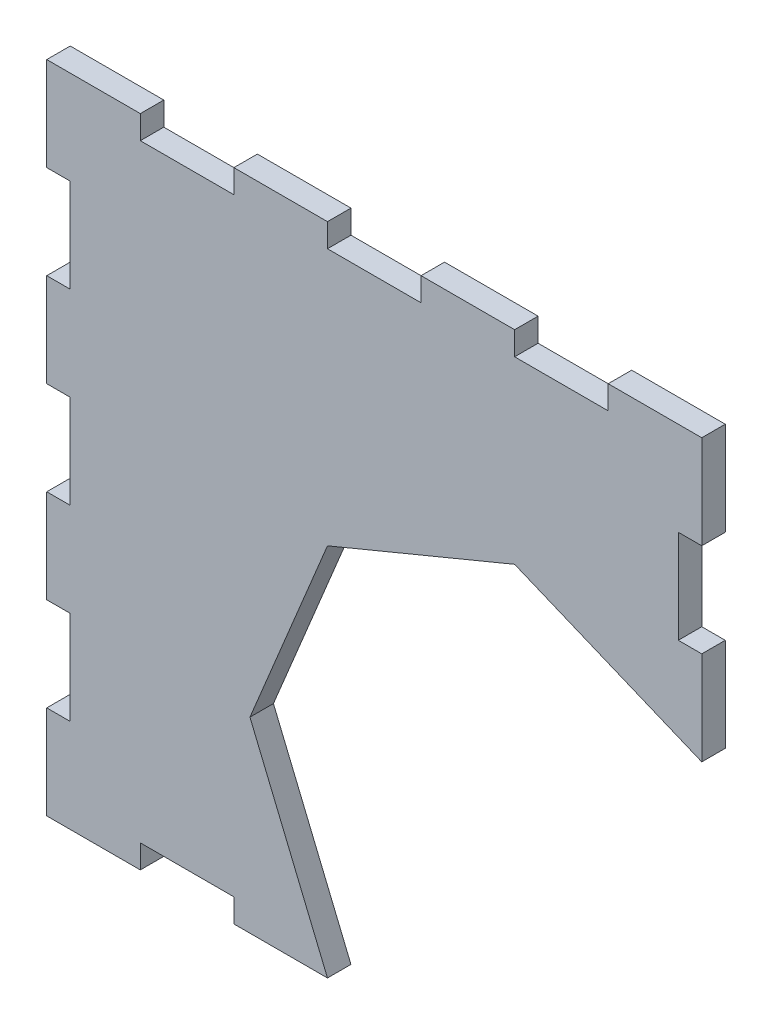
ISO-10303-21;
HEADER;
FILE_DESCRIPTION(('STEP AP214'),'2;1');
FILE_NAME('part.step','',(''),(''),'','','');
FILE_SCHEMA(('AUTOMOTIVE_DESIGN { 1 0 10303 214 1 1 1 1 }'));
ENDSEC;
DATA;
#1=APPLICATION_CONTEXT('core data for automotive mechanical design processes');
#2=APPLICATION_PROTOCOL_DEFINITION('international standard','automotive_design',2000,#1);
#3=PRODUCT_CONTEXT('',#1,'mechanical');
#4=PRODUCT('Part','Part','',(#3));
#5=PRODUCT_RELATED_PRODUCT_CATEGORY('part','',(#4));
#6=PRODUCT_DEFINITION_FORMATION('','',#4);
#7=PRODUCT_DEFINITION_CONTEXT('part definition',#1,'design');
#8=PRODUCT_DEFINITION('design','',#6,#7);
#9=PRODUCT_DEFINITION_SHAPE('','',#8);
#10=(LENGTH_UNIT() NAMED_UNIT(*) SI_UNIT(.MILLI.,.METRE.));
#11=(NAMED_UNIT(*) PLANE_ANGLE_UNIT() SI_UNIT($,.RADIAN.));
#12=(NAMED_UNIT(*) SI_UNIT($,.STERADIAN.) SOLID_ANGLE_UNIT());
#13=UNCERTAINTY_MEASURE_WITH_UNIT(LENGTH_MEASURE(1.E-05),#10,'distance_accuracy_value','');
#14=(GEOMETRIC_REPRESENTATION_CONTEXT(3) GLOBAL_UNCERTAINTY_ASSIGNED_CONTEXT((#13)) GLOBAL_UNIT_ASSIGNED_CONTEXT((#10,
#11,#12)) REPRESENTATION_CONTEXT('',''));
#15=CARTESIAN_POINT('',(0.,0.,0.));
#16=DIRECTION('',(0.,0.,1.));
#17=DIRECTION('',(1.,0.,0.));
#18=AXIS2_PLACEMENT_3D('',#15,#16,#17);
#19=CARTESIAN_POINT('',(-655.559435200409,-26.9424313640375,19.));
#20=DIRECTION('',(0.382683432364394,0.923879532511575,0.));
#21=DIRECTION('',(-0.923879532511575,0.382683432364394,0.));
#22=AXIS2_PLACEMENT_3D('',#19,#20,#21);
#23=PLANE('',#22);
#24=DIRECTION('',(0.923879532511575,-0.382683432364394,0.));
#25=VECTOR('',#24,1.);
#26=CARTESIAN_POINT('',(-655.559435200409,-26.9424313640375,0.));
#27=LINE('',#26,#25);
#28=CARTESIAN_POINT('',(-806.98800811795,35.7813372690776,0.));
#29=VERTEX_POINT('',#28);
#30=CARTESIAN_POINT('',(-655.559435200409,-26.9424313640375,0.));
#31=VERTEX_POINT('',#30);
#32=EDGE_CURVE('E321',#29,#31,#27,.T.);
#33=ORIENTED_EDGE('',*,*,#32,.T.);
#34=DIRECTION('',(0.,0.,-1.));
#35=VECTOR('',#34,1.);
#36=CARTESIAN_POINT('',(-655.559435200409,-26.9424313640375,19.));
#37=LINE('',#36,#35);
#38=CARTESIAN_POINT('',(-655.559435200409,-26.9424313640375,19.));
#39=VERTEX_POINT('',#38);
#40=EDGE_CURVE('E11',#39,#31,#37,.T.);
#41=ORIENTED_EDGE('',*,*,#40,.F.);
#42=DIRECTION('',(0.923879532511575,-0.382683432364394,0.));
#43=VECTOR('',#42,1.);
#44=CARTESIAN_POINT('',(-655.559435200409,-26.9424313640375,19.));
#45=LINE('',#44,#43);
#46=CARTESIAN_POINT('',(-806.98800811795,35.7813372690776,19.));
#47=VERTEX_POINT('',#46);
#48=EDGE_CURVE('E399',#47,#39,#45,.T.);
#49=ORIENTED_EDGE('',*,*,#48,.F.);
#50=DIRECTION('',(0.,0.,-1.));
#51=VECTOR('',#50,1.);
#52=CARTESIAN_POINT('',(-806.98800811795,35.7813372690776,19.));
#53=LINE('',#52,#51);
#54=EDGE_CURVE('E317',#47,#29,#53,.T.);
#55=ORIENTED_EDGE('',*,*,#54,.T.);
#56=EDGE_LOOP('',(#33,#41,#49,#55));
#57=FACE_BOUND('',#56,.T.);
#58=ADVANCED_FACE('F33',(#57),#23,.F.);
#59=CARTESIAN_POINT('',(-655.559435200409,48.7718550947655,19.));
#60=DIRECTION('',(-1.,0.,0.));
#61=DIRECTION('',(0.,0.,1.));
#62=AXIS2_PLACEMENT_3D('',#59,#60,#61);
#63=PLANE('',#62);
#64=DIRECTION('',(0.,1.,0.));
#65=VECTOR('',#64,1.);
#66=CARTESIAN_POINT('',(-655.559435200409,48.7718550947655,0.));
#67=LINE('',#66,#65);
#68=CARTESIAN_POINT('',(-655.559435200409,48.7718550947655,0.));
#69=VERTEX_POINT('',#68);
#70=EDGE_CURVE('E324',#31,#69,#67,.T.);
#71=ORIENTED_EDGE('',*,*,#70,.T.);
#72=DIRECTION('',(0.,0.,-1.));
#73=VECTOR('',#72,1.);
#74=CARTESIAN_POINT('',(-655.559435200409,48.7718550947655,19.));
#75=LINE('',#74,#73);
#76=CARTESIAN_POINT('',(-655.559435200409,48.7718550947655,19.));
#77=VERTEX_POINT('',#76);
#78=EDGE_CURVE('E41',#77,#69,#75,.T.);
#79=ORIENTED_EDGE('',*,*,#78,.F.);
#80=DIRECTION('',(0.,1.,0.));
#81=VECTOR('',#80,1.);
#82=CARTESIAN_POINT('',(-655.559435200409,48.7718550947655,19.));
#83=LINE('',#82,#81);
#84=EDGE_CURVE('E188',#39,#77,#83,.T.);
#85=ORIENTED_EDGE('',*,*,#84,.F.);
#86=ORIENTED_EDGE('',*,*,#40,.T.);
#87=EDGE_LOOP('',(#71,#79,#85,#86));
#88=FACE_BOUND('',#87,.T.);
#89=ADVANCED_FACE('F617',(#88),#63,.F.);
#90=CARTESIAN_POINT('',(-674.559435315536,48.7718550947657,19.));
#91=DIRECTION('',(0.,-1.,0.));
#92=DIRECTION('',(1.,0.,0.));
#93=AXIS2_PLACEMENT_3D('',#90,#91,#92);
#94=PLANE('',#93);
#95=DIRECTION('',(-1.,0.,0.));
#96=VECTOR('',#95,1.);
#97=CARTESIAN_POINT('',(-674.559435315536,48.7718550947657,0.));
#98=LINE('',#97,#96);
#99=CARTESIAN_POINT('',(-674.559435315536,48.7718550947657,0.));
#100=VERTEX_POINT('',#99);
#101=EDGE_CURVE('E326',#69,#100,#98,.T.);
#102=ORIENTED_EDGE('',*,*,#101,.T.);
#103=DIRECTION('',(0.,0.,-1.));
#104=VECTOR('',#103,1.);
#105=CARTESIAN_POINT('',(-674.559435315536,48.7718550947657,19.));
#106=LINE('',#105,#104);
#107=CARTESIAN_POINT('',(-674.559435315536,48.7718550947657,19.));
#108=VERTEX_POINT('',#107);
#109=EDGE_CURVE('E502',#108,#100,#106,.T.);
#110=ORIENTED_EDGE('',*,*,#109,.F.);
#111=DIRECTION('',(-1.,0.,0.));
#112=VECTOR('',#111,1.);
#113=CARTESIAN_POINT('',(-674.559435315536,48.7718550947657,19.));
#114=LINE('',#113,#112);
#115=EDGE_CURVE('E510',#77,#108,#114,.T.);
#116=ORIENTED_EDGE('',*,*,#115,.F.);
#117=ORIENTED_EDGE('',*,*,#78,.T.);
#118=EDGE_LOOP('',(#102,#110,#116,#117));
#119=FACE_BOUND('',#118,.T.);
#120=ADVANCED_FACE('F508',(#119),#94,.F.);
#121=CARTESIAN_POINT('',(-674.559435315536,124.486141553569,19.));
#122=DIRECTION('',(-1.,0.,0.));
#123=DIRECTION('',(0.,0.,1.));
#124=AXIS2_PLACEMENT_3D('',#121,#122,#123);
#125=PLANE('',#124);
#126=DIRECTION('',(0.,1.,0.));
#127=VECTOR('',#126,1.);
#128=CARTESIAN_POINT('',(-674.559435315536,124.486141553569,0.));
#129=LINE('',#128,#127);
#130=CARTESIAN_POINT('',(-674.559435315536,124.486141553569,0.));
#131=VERTEX_POINT('',#130);
#132=EDGE_CURVE('E328',#100,#131,#129,.T.);
#133=ORIENTED_EDGE('',*,*,#132,.T.);
#134=DIRECTION('',(0.,0.,-1.));
#135=VECTOR('',#134,1.);
#136=CARTESIAN_POINT('',(-674.559435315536,124.486141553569,19.));
#137=LINE('',#136,#135);
#138=CARTESIAN_POINT('',(-674.559435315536,124.486141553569,19.));
#139=VERTEX_POINT('',#138);
#140=EDGE_CURVE('E499',#139,#131,#137,.T.);
#141=ORIENTED_EDGE('',*,*,#140,.F.);
#142=DIRECTION('',(0.,1.,0.));
#143=VECTOR('',#142,1.);
#144=CARTESIAN_POINT('',(-674.559435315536,124.486141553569,19.));
#145=LINE('',#144,#143);
#146=EDGE_CURVE('E528',#108,#139,#145,.T.);
#147=ORIENTED_EDGE('',*,*,#146,.F.);
#148=ORIENTED_EDGE('',*,*,#109,.T.);
#149=EDGE_LOOP('',(#133,#141,#147,#148));
#150=FACE_BOUND('',#149,.T.);
#151=ADVANCED_FACE('F519',(#150),#125,.F.);
#152=CARTESIAN_POINT('',(-674.559435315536,124.486141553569,19.));
#153=DIRECTION('',(0.,1.,0.));
#154=DIRECTION('',(-1.,0.,0.));
#155=AXIS2_PLACEMENT_3D('',#152,#153,#154);
#156=PLANE('',#155);
#157=DIRECTION('',(1.,0.,0.));
#158=VECTOR('',#157,1.);
#159=CARTESIAN_POINT('',(-674.559435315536,124.486141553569,0.));
#160=LINE('',#159,#158);
#161=CARTESIAN_POINT('',(-655.559435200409,124.486141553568,0.));
#162=VERTEX_POINT('',#161);
#163=EDGE_CURVE('E330',#131,#162,#160,.T.);
#164=ORIENTED_EDGE('',*,*,#163,.T.);
#165=DIRECTION('',(0.,0.,-1.));
#166=VECTOR('',#165,1.);
#167=CARTESIAN_POINT('',(-655.559435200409,124.486141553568,19.));
#168=LINE('',#167,#166);
#169=CARTESIAN_POINT('',(-655.559435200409,124.486141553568,19.));
#170=VERTEX_POINT('',#169);
#171=EDGE_CURVE('E496',#170,#162,#168,.T.);
#172=ORIENTED_EDGE('',*,*,#171,.F.);
#173=DIRECTION('',(1.,0.,0.));
#174=VECTOR('',#173,1.);
#175=CARTESIAN_POINT('',(-674.559435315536,124.486141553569,19.));
#176=LINE('',#175,#174);
#177=EDGE_CURVE('E525',#139,#170,#176,.T.);
#178=ORIENTED_EDGE('',*,*,#177,.F.);
#179=ORIENTED_EDGE('',*,*,#140,.T.);
#180=EDGE_LOOP('',(#164,#172,#178,#179));
#181=FACE_BOUND('',#180,.T.);
#182=ADVANCED_FACE('F523',(#181),#156,.F.);
#183=CARTESIAN_POINT('',(-655.559435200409,200.200428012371,19.));
#184=DIRECTION('',(-1.,0.,0.));
#185=DIRECTION('',(0.,0.,1.));
#186=AXIS2_PLACEMENT_3D('',#183,#184,#185);
#187=PLANE('',#186);
#188=DIRECTION('',(0.,1.,0.));
#189=VECTOR('',#188,1.);
#190=CARTESIAN_POINT('',(-655.559435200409,200.200428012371,0.));
#191=LINE('',#190,#189);
#192=CARTESIAN_POINT('',(-655.559435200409,200.200428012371,0.));
#193=VERTEX_POINT('',#192);
#194=EDGE_CURVE('E332',#162,#193,#191,.T.);
#195=ORIENTED_EDGE('',*,*,#194,.T.);
#196=DIRECTION('',(0.,0.,-1.));
#197=VECTOR('',#196,1.);
#198=CARTESIAN_POINT('',(-655.559435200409,200.200428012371,19.));
#199=LINE('',#198,#197);
#200=CARTESIAN_POINT('',(-655.559435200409,200.200428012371,19.));
#201=VERTEX_POINT('',#200);
#202=EDGE_CURVE('E493',#201,#193,#199,.T.);
#203=ORIENTED_EDGE('',*,*,#202,.F.);
#204=DIRECTION('',(0.,1.,0.));
#205=VECTOR('',#204,1.);
#206=CARTESIAN_POINT('',(-655.559435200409,200.200428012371,19.));
#207=LINE('',#206,#205);
#208=EDGE_CURVE('E527',#170,#201,#207,.T.);
#209=ORIENTED_EDGE('',*,*,#208,.F.);
#210=ORIENTED_EDGE('',*,*,#171,.T.);
#211=EDGE_LOOP('',(#195,#203,#209,#210));
#212=FACE_BOUND('',#211,.T.);
#213=ADVANCED_FACE('F630',(#212),#187,.F.);
#214=CARTESIAN_POINT('',(-731.273721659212,200.200428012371,19.));
#215=DIRECTION('',(0.,-1.,0.));
#216=DIRECTION('',(0.,0.,-1.));
#217=AXIS2_PLACEMENT_3D('',#214,#215,#216);
#218=PLANE('',#217);
#219=DIRECTION('',(-1.,0.,0.));
#220=VECTOR('',#219,1.);
#221=CARTESIAN_POINT('',(-731.273721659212,200.200428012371,0.));
#222=LINE('',#221,#220);
#223=CARTESIAN_POINT('',(-731.273721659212,200.200428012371,0.));
#224=VERTEX_POINT('',#223);
#225=EDGE_CURVE('E334',#193,#224,#222,.T.);
#226=ORIENTED_EDGE('',*,*,#225,.T.);
#227=DIRECTION('',(0.,0.,-1.));
#228=VECTOR('',#227,1.);
#229=CARTESIAN_POINT('',(-731.273721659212,200.200428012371,19.));
#230=LINE('',#229,#228);
#231=CARTESIAN_POINT('',(-731.273721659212,200.200428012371,19.));
#232=VERTEX_POINT('',#231);
#233=EDGE_CURVE('E490',#232,#224,#230,.T.);
#234=ORIENTED_EDGE('',*,*,#233,.F.);
#235=DIRECTION('',(-1.,0.,0.));
#236=VECTOR('',#235,1.);
#237=CARTESIAN_POINT('',(-731.273721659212,200.200428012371,19.));
#238=LINE('',#237,#236);
#239=EDGE_CURVE('E530',#201,#232,#238,.T.);
#240=ORIENTED_EDGE('',*,*,#239,.F.);
#241=ORIENTED_EDGE('',*,*,#202,.T.);
#242=EDGE_LOOP('',(#226,#234,#240,#241));
#243=FACE_BOUND('',#242,.T.);
#244=ADVANCED_FACE('F633',(#243),#218,.F.);
#245=CARTESIAN_POINT('',(-731.273721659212,200.200428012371,19.));
#246=DIRECTION('',(1.,-1.110223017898E-13,0.));
#247=DIRECTION('',(1.110223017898E-13,1.,0.));
#248=AXIS2_PLACEMENT_3D('',#245,#246,#247);
#249=PLANE('',#248);
#250=DIRECTION('',(-1.110223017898E-13,-1.,0.));
#251=VECTOR('',#250,1.);
#252=CARTESIAN_POINT('',(-731.273721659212,200.200428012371,0.));
#253=LINE('',#252,#251);
#254=CARTESIAN_POINT('',(-731.273721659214,181.200427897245,0.));
#255=VERTEX_POINT('',#254);
#256=EDGE_CURVE('E336',#224,#255,#253,.T.);
#257=ORIENTED_EDGE('',*,*,#256,.T.);
#258=DIRECTION('',(0.,0.,-1.));
#259=VECTOR('',#258,1.);
#260=CARTESIAN_POINT('',(-731.273721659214,181.200427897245,19.));
#261=LINE('',#260,#259);
#262=CARTESIAN_POINT('',(-731.273721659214,181.200427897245,19.));
#263=VERTEX_POINT('',#262);
#264=EDGE_CURVE('E487',#263,#255,#261,.T.);
#265=ORIENTED_EDGE('',*,*,#264,.F.);
#266=DIRECTION('',(-1.110223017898E-13,-1.,0.));
#267=VECTOR('',#266,1.);
#268=CARTESIAN_POINT('',(-731.273721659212,200.200428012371,19.));
#269=LINE('',#268,#267);
#270=EDGE_CURVE('E536',#232,#263,#269,.T.);
#271=ORIENTED_EDGE('',*,*,#270,.F.);
#272=ORIENTED_EDGE('',*,*,#233,.T.);
#273=EDGE_LOOP('',(#257,#265,#271,#272));
#274=FACE_BOUND('',#273,.T.);
#275=ADVANCED_FACE('F637',(#274),#249,.F.);
#276=CARTESIAN_POINT('',(-806.988008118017,181.200427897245,19.));
#277=DIRECTION('',(0.,-1.,0.));
#278=DIRECTION('',(0.,0.,-1.));
#279=AXIS2_PLACEMENT_3D('',#276,#277,#278);
#280=PLANE('',#279);
#281=DIRECTION('',(-1.,0.,0.));
#282=VECTOR('',#281,1.);
#283=CARTESIAN_POINT('',(-806.988008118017,181.200427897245,0.));
#284=LINE('',#283,#282);
#285=CARTESIAN_POINT('',(-806.988008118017,181.200427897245,0.));
#286=VERTEX_POINT('',#285);
#287=EDGE_CURVE('E338',#255,#286,#284,.T.);
#288=ORIENTED_EDGE('',*,*,#287,.T.);
#289=DIRECTION('',(0.,0.,-1.));
#290=VECTOR('',#289,1.);
#291=CARTESIAN_POINT('',(-806.988008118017,181.200427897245,19.));
#292=LINE('',#291,#290);
#293=CARTESIAN_POINT('',(-806.988008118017,181.200427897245,19.));
#294=VERTEX_POINT('',#293);
#295=EDGE_CURVE('E484',#294,#286,#292,.T.);
#296=ORIENTED_EDGE('',*,*,#295,.F.);
#297=DIRECTION('',(-1.,0.,0.));
#298=VECTOR('',#297,1.);
#299=CARTESIAN_POINT('',(-806.988008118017,181.200427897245,19.));
#300=LINE('',#299,#298);
#301=EDGE_CURVE('E538',#263,#294,#300,.T.);
#302=ORIENTED_EDGE('',*,*,#301,.F.);
#303=ORIENTED_EDGE('',*,*,#264,.T.);
#304=EDGE_LOOP('',(#288,#296,#302,#303));
#305=FACE_BOUND('',#304,.T.);
#306=ADVANCED_FACE('F641',(#305),#280,.F.);
#307=CARTESIAN_POINT('',(-806.988008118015,200.200428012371,19.));
#308=DIRECTION('',(-1.,1.05179022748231E-13,0.));
#309=DIRECTION('',(-1.05179022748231E-13,-1.,0.));
#310=AXIS2_PLACEMENT_3D('',#307,#308,#309);
#311=PLANE('',#310);
#312=DIRECTION('',(1.05179022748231E-13,1.,0.));
#313=VECTOR('',#312,1.);
#314=CARTESIAN_POINT('',(-806.988008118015,200.200428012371,0.));
#315=LINE('',#314,#313);
#316=CARTESIAN_POINT('',(-806.988008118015,200.200428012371,0.));
#317=VERTEX_POINT('',#316);
#318=EDGE_CURVE('E340',#286,#317,#315,.T.);
#319=ORIENTED_EDGE('',*,*,#318,.T.);
#320=DIRECTION('',(0.,0.,-1.));
#321=VECTOR('',#320,1.);
#322=CARTESIAN_POINT('',(-806.988008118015,200.200428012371,19.));
#323=LINE('',#322,#321);
#324=CARTESIAN_POINT('',(-806.988008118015,200.200428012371,19.));
#325=VERTEX_POINT('',#324);
#326=EDGE_CURVE('E481',#325,#317,#323,.T.);
#327=ORIENTED_EDGE('',*,*,#326,.F.);
#328=DIRECTION('',(1.05179022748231E-13,1.,0.));
#329=VECTOR('',#328,1.);
#330=CARTESIAN_POINT('',(-806.988008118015,200.200428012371,19.));
#331=LINE('',#330,#329);
#332=EDGE_CURVE('E540',#294,#325,#331,.T.);
#333=ORIENTED_EDGE('',*,*,#332,.F.);
#334=ORIENTED_EDGE('',*,*,#295,.T.);
#335=EDGE_LOOP('',(#319,#327,#333,#334));
#336=FACE_BOUND('',#335,.T.);
#337=ADVANCED_FACE('F645',(#336),#311,.F.);
#338=CARTESIAN_POINT('',(-882.702294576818,200.200428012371,19.));
#339=DIRECTION('',(0.,-1.,0.));
#340=DIRECTION('',(0.,0.,-1.));
#341=AXIS2_PLACEMENT_3D('',#338,#339,#340);
#342=PLANE('',#341);
#343=DIRECTION('',(-1.,0.,0.));
#344=VECTOR('',#343,1.);
#345=CARTESIAN_POINT('',(-882.702294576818,200.200428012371,0.));
#346=LINE('',#345,#344);
#347=CARTESIAN_POINT('',(-882.702294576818,200.200428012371,0.));
#348=VERTEX_POINT('',#347);
#349=EDGE_CURVE('E342',#317,#348,#346,.T.);
#350=ORIENTED_EDGE('',*,*,#349,.T.);
#351=DIRECTION('',(0.,0.,-1.));
#352=VECTOR('',#351,1.);
#353=CARTESIAN_POINT('',(-882.702294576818,200.200428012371,19.));
#354=LINE('',#353,#352);
#355=CARTESIAN_POINT('',(-882.702294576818,200.200428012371,19.));
#356=VERTEX_POINT('',#355);
#357=EDGE_CURVE('E478',#356,#348,#354,.T.);
#358=ORIENTED_EDGE('',*,*,#357,.F.);
#359=DIRECTION('',(-1.,0.,0.));
#360=VECTOR('',#359,1.);
#361=CARTESIAN_POINT('',(-882.702294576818,200.200428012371,19.));
#362=LINE('',#361,#360);
#363=EDGE_CURVE('E542',#325,#356,#362,.T.);
#364=ORIENTED_EDGE('',*,*,#363,.F.);
#365=ORIENTED_EDGE('',*,*,#326,.T.);
#366=EDGE_LOOP('',(#350,#358,#364,#365));
#367=FACE_BOUND('',#366,.T.);
#368=ADVANCED_FACE('F649',(#367),#342,.F.);
#369=CARTESIAN_POINT('',(-882.702294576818,200.200428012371,19.));
#370=DIRECTION('',(1.,-1.05179022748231E-13,0.));
#371=DIRECTION('',(1.05179022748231E-13,1.,0.));
#372=AXIS2_PLACEMENT_3D('',#369,#370,#371);
#373=PLANE('',#372);
#374=DIRECTION('',(-1.05179022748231E-13,-1.,0.));
#375=VECTOR('',#374,1.);
#376=CARTESIAN_POINT('',(-882.702294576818,200.200428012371,0.));
#377=LINE('',#376,#375);
#378=CARTESIAN_POINT('',(-882.70229457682,181.200427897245,0.));
#379=VERTEX_POINT('',#378);
#380=EDGE_CURVE('E344',#348,#379,#377,.T.);
#381=ORIENTED_EDGE('',*,*,#380,.T.);
#382=DIRECTION('',(0.,0.,-1.));
#383=VECTOR('',#382,1.);
#384=CARTESIAN_POINT('',(-882.70229457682,181.200427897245,19.));
#385=LINE('',#384,#383);
#386=CARTESIAN_POINT('',(-882.70229457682,181.200427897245,19.));
#387=VERTEX_POINT('',#386);
#388=EDGE_CURVE('E475',#387,#379,#385,.T.);
#389=ORIENTED_EDGE('',*,*,#388,.F.);
#390=DIRECTION('',(-1.05179022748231E-13,-1.,0.));
#391=VECTOR('',#390,1.);
#392=CARTESIAN_POINT('',(-882.702294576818,200.200428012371,19.));
#393=LINE('',#392,#391);
#394=EDGE_CURVE('E544',#356,#387,#393,.T.);
#395=ORIENTED_EDGE('',*,*,#394,.F.);
#396=ORIENTED_EDGE('',*,*,#357,.T.);
#397=EDGE_LOOP('',(#381,#389,#395,#396));
#398=FACE_BOUND('',#397,.T.);
#399=ADVANCED_FACE('F653',(#398),#373,.F.);
#400=CARTESIAN_POINT('',(-958.416581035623,181.200427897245,19.));
#401=DIRECTION('',(0.,-1.,0.));
#402=DIRECTION('',(0.,0.,-1.));
#403=AXIS2_PLACEMENT_3D('',#400,#401,#402);
#404=PLANE('',#403);
#405=DIRECTION('',(-1.,0.,0.));
#406=VECTOR('',#405,1.);
#407=CARTESIAN_POINT('',(-958.416581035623,181.200427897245,0.));
#408=LINE('',#407,#406);
#409=CARTESIAN_POINT('',(-958.416581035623,181.200427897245,0.));
#410=VERTEX_POINT('',#409);
#411=EDGE_CURVE('E346',#379,#410,#408,.T.);
#412=ORIENTED_EDGE('',*,*,#411,.T.);
#413=DIRECTION('',(0.,0.,-1.));
#414=VECTOR('',#413,1.);
#415=CARTESIAN_POINT('',(-958.416581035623,181.200427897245,19.));
#416=LINE('',#415,#414);
#417=CARTESIAN_POINT('',(-958.416581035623,181.200427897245,19.));
#418=VERTEX_POINT('',#417);
#419=EDGE_CURVE('E472',#418,#410,#416,.T.);
#420=ORIENTED_EDGE('',*,*,#419,.F.);
#421=DIRECTION('',(-1.,0.,0.));
#422=VECTOR('',#421,1.);
#423=CARTESIAN_POINT('',(-958.416581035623,181.200427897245,19.));
#424=LINE('',#423,#422);
#425=EDGE_CURVE('E546',#387,#418,#424,.T.);
#426=ORIENTED_EDGE('',*,*,#425,.F.);
#427=ORIENTED_EDGE('',*,*,#388,.T.);
#428=EDGE_LOOP('',(#412,#420,#426,#427));
#429=FACE_BOUND('',#428,.T.);
#430=ADVANCED_FACE('F657',(#429),#404,.F.);
#431=CARTESIAN_POINT('',(-958.416581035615,200.200428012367,19.));
#432=DIRECTION('',(-1.,4.03186253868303E-13,0.));
#433=DIRECTION('',(-4.03186253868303E-13,-1.,0.));
#434=AXIS2_PLACEMENT_3D('',#431,#432,#433);
#435=PLANE('',#434);
#436=DIRECTION('',(4.03186253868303E-13,1.,0.));
#437=VECTOR('',#436,1.);
#438=CARTESIAN_POINT('',(-958.416581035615,200.200428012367,0.));
#439=LINE('',#438,#437);
#440=CARTESIAN_POINT('',(-958.416581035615,200.200428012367,0.));
#441=VERTEX_POINT('',#440);
#442=EDGE_CURVE('E348',#410,#441,#439,.T.);
#443=ORIENTED_EDGE('',*,*,#442,.T.);
#444=DIRECTION('',(0.,0.,-1.));
#445=VECTOR('',#444,1.);
#446=CARTESIAN_POINT('',(-958.416581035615,200.200428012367,19.));
#447=LINE('',#446,#445);
#448=CARTESIAN_POINT('',(-958.416581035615,200.200428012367,19.));
#449=VERTEX_POINT('',#448);
#450=EDGE_CURVE('E469',#449,#441,#447,.T.);
#451=ORIENTED_EDGE('',*,*,#450,.F.);
#452=DIRECTION('',(4.03186253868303E-13,1.,0.));
#453=VECTOR('',#452,1.);
#454=CARTESIAN_POINT('',(-958.416581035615,200.200428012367,19.));
#455=LINE('',#454,#453);
#456=EDGE_CURVE('E548',#418,#449,#455,.T.);
#457=ORIENTED_EDGE('',*,*,#456,.F.);
#458=ORIENTED_EDGE('',*,*,#419,.T.);
#459=EDGE_LOOP('',(#443,#451,#457,#458));
#460=FACE_BOUND('',#459,.T.);
#461=ADVANCED_FACE('F661',(#460),#435,.F.);
#462=CARTESIAN_POINT('',(-1034.13086749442,200.200428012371,19.));
#463=DIRECTION('',(0.,-1.,0.));
#464=DIRECTION('',(1.,0.,0.));
#465=AXIS2_PLACEMENT_3D('',#462,#463,#464);
#466=PLANE('',#465);
#467=DIRECTION('',(-1.,0.,0.));
#468=VECTOR('',#467,1.);
#469=CARTESIAN_POINT('',(-1034.13086749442,200.200428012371,0.));
#470=LINE('',#469,#468);
#471=CARTESIAN_POINT('',(-1034.13086749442,200.200428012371,0.));
#472=VERTEX_POINT('',#471);
#473=EDGE_CURVE('E350',#441,#472,#470,.T.);
#474=ORIENTED_EDGE('',*,*,#473,.T.);
#475=DIRECTION('',(0.,0.,-1.));
#476=VECTOR('',#475,1.);
#477=CARTESIAN_POINT('',(-1034.13086749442,200.200428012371,19.));
#478=LINE('',#477,#476);
#479=CARTESIAN_POINT('',(-1034.13086749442,200.200428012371,19.));
#480=VERTEX_POINT('',#479);
#481=EDGE_CURVE('E466',#480,#472,#478,.T.);
#482=ORIENTED_EDGE('',*,*,#481,.F.);
#483=DIRECTION('',(-1.,0.,0.));
#484=VECTOR('',#483,1.);
#485=CARTESIAN_POINT('',(-1034.13086749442,200.200428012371,19.));
#486=LINE('',#485,#484);
#487=EDGE_CURVE('E550',#449,#480,#486,.T.);
#488=ORIENTED_EDGE('',*,*,#487,.F.);
#489=ORIENTED_EDGE('',*,*,#450,.T.);
#490=EDGE_LOOP('',(#474,#482,#488,#489));
#491=FACE_BOUND('',#490,.T.);
#492=ADVANCED_FACE('F665',(#491),#466,.F.);
#493=CARTESIAN_POINT('',(-1034.13086749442,200.200428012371,19.));
#494=DIRECTION('',(1.,-1.05179022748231E-13,0.));
#495=DIRECTION('',(1.05179022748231E-13,1.,0.));
#496=AXIS2_PLACEMENT_3D('',#493,#494,#495);
#497=PLANE('',#496);
#498=DIRECTION('',(-1.05179022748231E-13,-1.,0.));
#499=VECTOR('',#498,1.);
#500=CARTESIAN_POINT('',(-1034.13086749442,200.200428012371,0.));
#501=LINE('',#500,#499);
#502=CARTESIAN_POINT('',(-1034.13086749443,181.200427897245,0.));
#503=VERTEX_POINT('',#502);
#504=EDGE_CURVE('E352',#472,#503,#501,.T.);
#505=ORIENTED_EDGE('',*,*,#504,.T.);
#506=DIRECTION('',(0.,0.,-1.));
#507=VECTOR('',#506,1.);
#508=CARTESIAN_POINT('',(-1034.13086749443,181.200427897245,19.));
#509=LINE('',#508,#507);
#510=CARTESIAN_POINT('',(-1034.13086749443,181.200427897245,19.));
#511=VERTEX_POINT('',#510);
#512=EDGE_CURVE('E463',#511,#503,#509,.T.);
#513=ORIENTED_EDGE('',*,*,#512,.F.);
#514=DIRECTION('',(-1.05179022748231E-13,-1.,0.));
#515=VECTOR('',#514,1.);
#516=CARTESIAN_POINT('',(-1034.13086749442,200.200428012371,19.));
#517=LINE('',#516,#515);
#518=EDGE_CURVE('E552',#480,#511,#517,.T.);
#519=ORIENTED_EDGE('',*,*,#518,.F.);
#520=ORIENTED_EDGE('',*,*,#481,.T.);
#521=EDGE_LOOP('',(#505,#513,#519,#520));
#522=FACE_BOUND('',#521,.T.);
#523=ADVANCED_FACE('F669',(#522),#497,.F.);
#524=CARTESIAN_POINT('',(-1109.84515395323,181.200427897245,19.));
#525=DIRECTION('',(0.,-1.,0.));
#526=DIRECTION('',(0.,0.,-1.));
#527=AXIS2_PLACEMENT_3D('',#524,#525,#526);
#528=PLANE('',#527);
#529=DIRECTION('',(-1.,0.,0.));
#530=VECTOR('',#529,1.);
#531=CARTESIAN_POINT('',(-1109.84515395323,181.200427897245,0.));
#532=LINE('',#531,#530);
#533=CARTESIAN_POINT('',(-1109.84515395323,181.200427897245,0.));
#534=VERTEX_POINT('',#533);
#535=EDGE_CURVE('E354',#503,#534,#532,.T.);
#536=ORIENTED_EDGE('',*,*,#535,.T.);
#537=DIRECTION('',(0.,0.,-1.));
#538=VECTOR('',#537,1.);
#539=CARTESIAN_POINT('',(-1109.84515395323,181.200427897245,19.));
#540=LINE('',#539,#538);
#541=CARTESIAN_POINT('',(-1109.84515395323,181.200427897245,19.));
#542=VERTEX_POINT('',#541);
#543=EDGE_CURVE('E460',#542,#534,#540,.T.);
#544=ORIENTED_EDGE('',*,*,#543,.F.);
#545=DIRECTION('',(-1.,0.,0.));
#546=VECTOR('',#545,1.);
#547=CARTESIAN_POINT('',(-1109.84515395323,181.200427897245,19.));
#548=LINE('',#547,#546);
#549=EDGE_CURVE('E554',#511,#542,#548,.T.);
#550=ORIENTED_EDGE('',*,*,#549,.F.);
#551=ORIENTED_EDGE('',*,*,#512,.T.);
#552=EDGE_LOOP('',(#536,#544,#550,#551));
#553=FACE_BOUND('',#552,.T.);
#554=ADVANCED_FACE('F673',(#553),#528,.F.);
#555=CARTESIAN_POINT('',(-1109.84515395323,200.200428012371,19.));
#556=DIRECTION('',(-1.,0.,0.));
#557=DIRECTION('',(0.,-1.,0.));
#558=AXIS2_PLACEMENT_3D('',#555,#556,#557);
#559=PLANE('',#558);
#560=DIRECTION('',(0.,1.,0.));
#561=VECTOR('',#560,1.);
#562=CARTESIAN_POINT('',(-1109.84515395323,200.200428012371,0.));
#563=LINE('',#562,#561);
#564=CARTESIAN_POINT('',(-1109.84515395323,200.200428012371,0.));
#565=VERTEX_POINT('',#564);
#566=EDGE_CURVE('E356',#534,#565,#563,.T.);
#567=ORIENTED_EDGE('',*,*,#566,.T.);
#568=DIRECTION('',(0.,0.,-1.));
#569=VECTOR('',#568,1.);
#570=CARTESIAN_POINT('',(-1109.84515395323,200.200428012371,19.));
#571=LINE('',#570,#569);
#572=CARTESIAN_POINT('',(-1109.84515395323,200.200428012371,19.));
#573=VERTEX_POINT('',#572);
#574=EDGE_CURVE('E457',#573,#565,#571,.T.);
#575=ORIENTED_EDGE('',*,*,#574,.F.);
#576=DIRECTION('',(0.,1.,0.));
#577=VECTOR('',#576,1.);
#578=CARTESIAN_POINT('',(-1109.84515395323,200.200428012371,19.));
#579=LINE('',#578,#577);
#580=EDGE_CURVE('E556',#542,#573,#579,.T.);
#581=ORIENTED_EDGE('',*,*,#580,.F.);
#582=ORIENTED_EDGE('',*,*,#543,.T.);
#583=EDGE_LOOP('',(#567,#575,#581,#582));
#584=FACE_BOUND('',#583,.T.);
#585=ADVANCED_FACE('F677',(#584),#559,.F.);
#586=CARTESIAN_POINT('',(-1185.55944041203,200.200428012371,19.));
#587=DIRECTION('',(0.,-1.,0.));
#588=DIRECTION('',(0.,0.,-1.));
#589=AXIS2_PLACEMENT_3D('',#586,#587,#588);
#590=PLANE('',#589);
#591=DIRECTION('',(-1.,0.,0.));
#592=VECTOR('',#591,1.);
#593=CARTESIAN_POINT('',(-1185.55944041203,200.200428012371,0.));
#594=LINE('',#593,#592);
#595=CARTESIAN_POINT('',(-1185.55944041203,200.200428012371,0.));
#596=VERTEX_POINT('',#595);
#597=EDGE_CURVE('E358',#565,#596,#594,.T.);
#598=ORIENTED_EDGE('',*,*,#597,.T.);
#599=DIRECTION('',(0.,0.,-1.));
#600=VECTOR('',#599,1.);
#601=CARTESIAN_POINT('',(-1185.55944041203,200.200428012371,19.));
#602=LINE('',#601,#600);
#603=CARTESIAN_POINT('',(-1185.55944041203,200.200428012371,19.));
#604=VERTEX_POINT('',#603);
#605=EDGE_CURVE('E454',#604,#596,#602,.T.);
#606=ORIENTED_EDGE('',*,*,#605,.F.);
#607=DIRECTION('',(-1.,0.,0.));
#608=VECTOR('',#607,1.);
#609=CARTESIAN_POINT('',(-1185.55944041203,200.200428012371,19.));
#610=LINE('',#609,#608);
#611=EDGE_CURVE('E558',#573,#604,#610,.T.);
#612=ORIENTED_EDGE('',*,*,#611,.F.);
#613=ORIENTED_EDGE('',*,*,#574,.T.);
#614=EDGE_LOOP('',(#598,#606,#612,#613));
#615=FACE_BOUND('',#614,.T.);
#616=ADVANCED_FACE('F681',(#615),#590,.F.);
#617=CARTESIAN_POINT('',(-1185.55944041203,200.200428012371,19.));
#618=DIRECTION('',(1.,0.,0.));
#619=DIRECTION('',(0.,0.,-1.));
#620=AXIS2_PLACEMENT_3D('',#617,#618,#619);
#621=PLANE('',#620);
#622=DIRECTION('',(0.,-1.,0.));
#623=VECTOR('',#622,1.);
#624=CARTESIAN_POINT('',(-1185.55944041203,200.200428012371,0.));
#625=LINE('',#624,#623);
#626=CARTESIAN_POINT('',(-1185.55944041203,124.486141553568,0.));
#627=VERTEX_POINT('',#626);
#628=EDGE_CURVE('E360',#596,#627,#625,.T.);
#629=ORIENTED_EDGE('',*,*,#628,.T.);
#630=DIRECTION('',(0.,0.,-1.));
#631=VECTOR('',#630,1.);
#632=CARTESIAN_POINT('',(-1185.55944041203,124.486141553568,19.));
#633=LINE('',#632,#631);
#634=CARTESIAN_POINT('',(-1185.55944041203,124.486141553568,19.));
#635=VERTEX_POINT('',#634);
#636=EDGE_CURVE('E451',#635,#627,#633,.T.);
#637=ORIENTED_EDGE('',*,*,#636,.F.);
#638=DIRECTION('',(0.,-1.,0.));
#639=VECTOR('',#638,1.);
#640=CARTESIAN_POINT('',(-1185.55944041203,200.200428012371,19.));
#641=LINE('',#640,#639);
#642=EDGE_CURVE('E560',#604,#635,#641,.T.);
#643=ORIENTED_EDGE('',*,*,#642,.F.);
#644=ORIENTED_EDGE('',*,*,#605,.T.);
#645=EDGE_LOOP('',(#629,#637,#643,#644));
#646=FACE_BOUND('',#645,.T.);
#647=ADVANCED_FACE('F685',(#646),#621,.F.);
#648=CARTESIAN_POINT('',(-1185.55944041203,124.486141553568,19.));
#649=DIRECTION('',(0.,1.,0.));
#650=DIRECTION('',(-1.,0.,0.));
#651=AXIS2_PLACEMENT_3D('',#648,#649,#650);
#652=PLANE('',#651);
#653=DIRECTION('',(1.,0.,0.));
#654=VECTOR('',#653,1.);
#655=CARTESIAN_POINT('',(-1185.55944041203,124.486141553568,0.));
#656=LINE('',#655,#654);
#657=CARTESIAN_POINT('',(-1166.55944029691,124.486141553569,0.));
#658=VERTEX_POINT('',#657);
#659=EDGE_CURVE('E362',#627,#658,#656,.T.);
#660=ORIENTED_EDGE('',*,*,#659,.T.);
#661=DIRECTION('',(0.,0.,-1.));
#662=VECTOR('',#661,1.);
#663=CARTESIAN_POINT('',(-1166.55944029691,124.486141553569,19.));
#664=LINE('',#663,#662);
#665=CARTESIAN_POINT('',(-1166.55944029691,124.486141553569,19.));
#666=VERTEX_POINT('',#665);
#667=EDGE_CURVE('E448',#666,#658,#664,.T.);
#668=ORIENTED_EDGE('',*,*,#667,.F.);
#669=DIRECTION('',(1.,0.,0.));
#670=VECTOR('',#669,1.);
#671=CARTESIAN_POINT('',(-1185.55944041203,124.486141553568,19.));
#672=LINE('',#671,#670);
#673=EDGE_CURVE('E562',#635,#666,#672,.T.);
#674=ORIENTED_EDGE('',*,*,#673,.F.);
#675=ORIENTED_EDGE('',*,*,#636,.T.);
#676=EDGE_LOOP('',(#660,#668,#674,#675));
#677=FACE_BOUND('',#676,.T.);
#678=ADVANCED_FACE('F689',(#677),#652,.F.);
#679=CARTESIAN_POINT('',(-1166.55944029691,124.486141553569,19.));
#680=DIRECTION('',(1.,0.,0.));
#681=DIRECTION('',(0.,0.,-1.));
#682=AXIS2_PLACEMENT_3D('',#679,#680,#681);
#683=PLANE('',#682);
#684=DIRECTION('',(0.,-1.,0.));
#685=VECTOR('',#684,1.);
#686=CARTESIAN_POINT('',(-1166.55944029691,124.486141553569,0.));
#687=LINE('',#686,#685);
#688=CARTESIAN_POINT('',(-1166.55944029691,48.7718550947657,0.));
#689=VERTEX_POINT('',#688);
#690=EDGE_CURVE('E364',#658,#689,#687,.T.);
#691=ORIENTED_EDGE('',*,*,#690,.T.);
#692=DIRECTION('',(0.,0.,-1.));
#693=VECTOR('',#692,1.);
#694=CARTESIAN_POINT('',(-1166.55944029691,48.7718550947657,19.));
#695=LINE('',#694,#693);
#696=CARTESIAN_POINT('',(-1166.55944029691,48.7718550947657,19.));
#697=VERTEX_POINT('',#696);
#698=EDGE_CURVE('E445',#697,#689,#695,.T.);
#699=ORIENTED_EDGE('',*,*,#698,.F.);
#700=DIRECTION('',(0.,-1.,0.));
#701=VECTOR('',#700,1.);
#702=CARTESIAN_POINT('',(-1166.55944029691,124.486141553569,19.));
#703=LINE('',#702,#701);
#704=EDGE_CURVE('E564',#666,#697,#703,.T.);
#705=ORIENTED_EDGE('',*,*,#704,.F.);
#706=ORIENTED_EDGE('',*,*,#667,.T.);
#707=EDGE_LOOP('',(#691,#699,#705,#706));
#708=FACE_BOUND('',#707,.T.);
#709=ADVANCED_FACE('F693',(#708),#683,.F.);
#710=CARTESIAN_POINT('',(-1185.55944041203,48.7718550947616,19.));
#711=DIRECTION('',(2.16201324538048E-13,-1.,0.));
#712=DIRECTION('',(1.,2.16201324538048E-13,0.));
#713=AXIS2_PLACEMENT_3D('',#710,#711,#712);
#714=PLANE('',#713);
#715=DIRECTION('',(-1.,-2.16201324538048E-13,0.));
#716=VECTOR('',#715,1.);
#717=CARTESIAN_POINT('',(-1185.55944041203,48.7718550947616,0.));
#718=LINE('',#717,#716);
#719=CARTESIAN_POINT('',(-1185.55944041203,48.7718550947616,0.));
#720=VERTEX_POINT('',#719);
#721=EDGE_CURVE('E366',#689,#720,#718,.T.);
#722=ORIENTED_EDGE('',*,*,#721,.T.);
#723=DIRECTION('',(0.,0.,-1.));
#724=VECTOR('',#723,1.);
#725=CARTESIAN_POINT('',(-1185.55944041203,48.7718550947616,19.));
#726=LINE('',#725,#724);
#727=CARTESIAN_POINT('',(-1185.55944041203,48.7718550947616,19.));
#728=VERTEX_POINT('',#727);
#729=EDGE_CURVE('E442',#728,#720,#726,.T.);
#730=ORIENTED_EDGE('',*,*,#729,.F.);
#731=DIRECTION('',(-1.,-2.16201324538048E-13,0.));
#732=VECTOR('',#731,1.);
#733=CARTESIAN_POINT('',(-1185.55944041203,48.7718550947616,19.));
#734=LINE('',#733,#732);
#735=EDGE_CURVE('E566',#697,#728,#734,.T.);
#736=ORIENTED_EDGE('',*,*,#735,.F.);
#737=ORIENTED_EDGE('',*,*,#698,.T.);
#738=EDGE_LOOP('',(#722,#730,#736,#737));
#739=FACE_BOUND('',#738,.T.);
#740=ADVANCED_FACE('F697',(#739),#714,.F.);
#741=CARTESIAN_POINT('',(-1185.55944041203,48.7718550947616,19.));
#742=DIRECTION('',(1.,0.,0.));
#743=DIRECTION('',(0.,1.,0.));
#744=AXIS2_PLACEMENT_3D('',#741,#742,#743);
#745=PLANE('',#744);
#746=DIRECTION('',(0.,-1.,0.));
#747=VECTOR('',#746,1.);
#748=CARTESIAN_POINT('',(-1185.55944041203,48.7718550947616,0.));
#749=LINE('',#748,#747);
#750=CARTESIAN_POINT('',(-1185.55944041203,-26.9424313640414,0.));
#751=VERTEX_POINT('',#750);
#752=EDGE_CURVE('E368',#720,#751,#749,.T.);
#753=ORIENTED_EDGE('',*,*,#752,.T.);
#754=DIRECTION('',(0.,0.,-1.));
#755=VECTOR('',#754,1.);
#756=CARTESIAN_POINT('',(-1185.55944041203,-26.9424313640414,19.));
#757=LINE('',#756,#755);
#758=CARTESIAN_POINT('',(-1185.55944041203,-26.9424313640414,19.));
#759=VERTEX_POINT('',#758);
#760=EDGE_CURVE('E439',#759,#751,#757,.T.);
#761=ORIENTED_EDGE('',*,*,#760,.F.);
#762=DIRECTION('',(0.,-1.,0.));
#763=VECTOR('',#762,1.);
#764=CARTESIAN_POINT('',(-1185.55944041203,48.7718550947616,19.));
#765=LINE('',#764,#763);
#766=EDGE_CURVE('E568',#728,#759,#765,.T.);
#767=ORIENTED_EDGE('',*,*,#766,.F.);
#768=ORIENTED_EDGE('',*,*,#729,.T.);
#769=EDGE_LOOP('',(#753,#761,#767,#768));
#770=FACE_BOUND('',#769,.T.);
#771=ADVANCED_FACE('F701',(#770),#745,.F.);
#772=CARTESIAN_POINT('',(-1185.55944041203,-26.9424313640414,19.));
#773=DIRECTION('',(-2.15836119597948E-13,1.,0.));
#774=DIRECTION('',(-1.,-2.15836119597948E-13,0.));
#775=AXIS2_PLACEMENT_3D('',#772,#773,#774);
#776=PLANE('',#775);
#777=DIRECTION('',(1.,2.15836119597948E-13,0.));
#778=VECTOR('',#777,1.);
#779=CARTESIAN_POINT('',(-1185.55944041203,-26.9424313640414,0.));
#780=LINE('',#779,#778);
#781=CARTESIAN_POINT('',(-1166.55944029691,-26.9424313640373,0.));
#782=VERTEX_POINT('',#781);
#783=EDGE_CURVE('E370',#751,#782,#780,.T.);
#784=ORIENTED_EDGE('',*,*,#783,.T.);
#785=DIRECTION('',(0.,0.,-1.));
#786=VECTOR('',#785,1.);
#787=CARTESIAN_POINT('',(-1166.55944029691,-26.9424313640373,19.));
#788=LINE('',#787,#786);
#789=CARTESIAN_POINT('',(-1166.55944029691,-26.9424313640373,19.));
#790=VERTEX_POINT('',#789);
#791=EDGE_CURVE('E436',#790,#782,#788,.T.);
#792=ORIENTED_EDGE('',*,*,#791,.F.);
#793=DIRECTION('',(1.,2.15836119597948E-13,0.));
#794=VECTOR('',#793,1.);
#795=CARTESIAN_POINT('',(-1185.55944041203,-26.9424313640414,19.));
#796=LINE('',#795,#794);
#797=EDGE_CURVE('E570',#759,#790,#796,.T.);
#798=ORIENTED_EDGE('',*,*,#797,.F.);
#799=ORIENTED_EDGE('',*,*,#760,.T.);
#800=EDGE_LOOP('',(#784,#792,#798,#799));
#801=FACE_BOUND('',#800,.T.);
#802=ADVANCED_FACE('F705',(#801),#776,.F.);
#803=CARTESIAN_POINT('',(-1166.55944029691,-26.9424313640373,19.));
#804=DIRECTION('',(1.,0.,0.));
#805=DIRECTION('',(0.,1.,0.));
#806=AXIS2_PLACEMENT_3D('',#803,#804,#805);
#807=PLANE('',#806);
#808=DIRECTION('',(0.,-1.,0.));
#809=VECTOR('',#808,1.);
#810=CARTESIAN_POINT('',(-1166.55944029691,-26.9424313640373,0.));
#811=LINE('',#810,#809);
#812=CARTESIAN_POINT('',(-1166.5594402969,-102.65671782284,0.));
#813=VERTEX_POINT('',#812);
#814=EDGE_CURVE('E372',#782,#813,#811,.T.);
#815=ORIENTED_EDGE('',*,*,#814,.T.);
#816=DIRECTION('',(0.,0.,-1.));
#817=VECTOR('',#816,1.);
#818=CARTESIAN_POINT('',(-1166.5594402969,-102.65671782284,19.));
#819=LINE('',#818,#817);
#820=CARTESIAN_POINT('',(-1166.5594402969,-102.65671782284,19.));
#821=VERTEX_POINT('',#820);
#822=EDGE_CURVE('E433',#821,#813,#819,.T.);
#823=ORIENTED_EDGE('',*,*,#822,.F.);
#824=DIRECTION('',(0.,-1.,0.));
#825=VECTOR('',#824,1.);
#826=CARTESIAN_POINT('',(-1166.55944029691,-26.9424313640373,19.));
#827=LINE('',#826,#825);
#828=EDGE_CURVE('E572',#790,#821,#827,.T.);
#829=ORIENTED_EDGE('',*,*,#828,.F.);
#830=ORIENTED_EDGE('',*,*,#791,.T.);
#831=EDGE_LOOP('',(#815,#823,#829,#830));
#832=FACE_BOUND('',#831,.T.);
#833=ADVANCED_FACE('F709',(#832),#807,.F.);
#834=CARTESIAN_POINT('',(-1185.55944041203,-102.656717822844,19.));
#835=DIRECTION('',(2.14740504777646E-13,-1.,0.));
#836=DIRECTION('',(1.,2.14740504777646E-13,0.));
#837=AXIS2_PLACEMENT_3D('',#834,#835,#836);
#838=PLANE('',#837);
#839=DIRECTION('',(-1.,-2.14740504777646E-13,0.));
#840=VECTOR('',#839,1.);
#841=CARTESIAN_POINT('',(-1185.55944041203,-102.656717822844,0.));
#842=LINE('',#841,#840);
#843=CARTESIAN_POINT('',(-1185.55944041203,-102.656717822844,0.));
#844=VERTEX_POINT('',#843);
#845=EDGE_CURVE('E374',#813,#844,#842,.T.);
#846=ORIENTED_EDGE('',*,*,#845,.T.);
#847=DIRECTION('',(0.,0.,-1.));
#848=VECTOR('',#847,1.);
#849=CARTESIAN_POINT('',(-1185.55944041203,-102.656717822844,19.));
#850=LINE('',#849,#848);
#851=CARTESIAN_POINT('',(-1185.55944041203,-102.656717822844,19.));
#852=VERTEX_POINT('',#851);
#853=EDGE_CURVE('E430',#852,#844,#850,.T.);
#854=ORIENTED_EDGE('',*,*,#853,.F.);
#855=DIRECTION('',(-1.,-2.14740504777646E-13,0.));
#856=VECTOR('',#855,1.);
#857=CARTESIAN_POINT('',(-1185.55944041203,-102.656717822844,19.));
#858=LINE('',#857,#856);
#859=EDGE_CURVE('E574',#821,#852,#858,.T.);
#860=ORIENTED_EDGE('',*,*,#859,.F.);
#861=ORIENTED_EDGE('',*,*,#822,.T.);
#862=EDGE_LOOP('',(#846,#854,#860,#861));
#863=FACE_BOUND('',#862,.T.);
#864=ADVANCED_FACE('F713',(#863),#838,.F.);
#865=CARTESIAN_POINT('',(-1185.55944041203,-102.656717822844,19.));
#866=DIRECTION('',(1.,0.,0.));
#867=DIRECTION('',(0.,1.,0.));
#868=AXIS2_PLACEMENT_3D('',#865,#866,#867);
#869=PLANE('',#868);
#870=DIRECTION('',(0.,-1.,0.));
#871=VECTOR('',#870,1.);
#872=CARTESIAN_POINT('',(-1185.55944041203,-102.656717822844,0.));
#873=LINE('',#872,#871);
#874=CARTESIAN_POINT('',(-1185.55944041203,-178.371004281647,0.));
#875=VERTEX_POINT('',#874);
#876=EDGE_CURVE('E376',#844,#875,#873,.T.);
#877=ORIENTED_EDGE('',*,*,#876,.T.);
#878=DIRECTION('',(0.,0.,-1.));
#879=VECTOR('',#878,1.);
#880=CARTESIAN_POINT('',(-1185.55944041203,-178.371004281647,19.));
#881=LINE('',#880,#879);
#882=CARTESIAN_POINT('',(-1185.55944041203,-178.371004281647,19.));
#883=VERTEX_POINT('',#882);
#884=EDGE_CURVE('E427',#883,#875,#881,.T.);
#885=ORIENTED_EDGE('',*,*,#884,.F.);
#886=DIRECTION('',(0.,-1.,0.));
#887=VECTOR('',#886,1.);
#888=CARTESIAN_POINT('',(-1185.55944041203,-102.656717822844,19.));
#889=LINE('',#888,#887);
#890=EDGE_CURVE('E576',#852,#883,#889,.T.);
#891=ORIENTED_EDGE('',*,*,#890,.F.);
#892=ORIENTED_EDGE('',*,*,#853,.T.);
#893=EDGE_LOOP('',(#877,#885,#891,#892));
#894=FACE_BOUND('',#893,.T.);
#895=ADVANCED_FACE('F717',(#894),#869,.F.);
#896=CARTESIAN_POINT('',(-1185.55944041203,-178.371004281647,19.));
#897=DIRECTION('',(-2.13279685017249E-13,1.,0.));
#898=DIRECTION('',(-1.,-2.13279685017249E-13,0.));
#899=AXIS2_PLACEMENT_3D('',#896,#897,#898);
#900=PLANE('',#899);
#901=DIRECTION('',(1.,2.13279685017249E-13,0.));
#902=VECTOR('',#901,1.);
#903=CARTESIAN_POINT('',(-1185.55944041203,-178.371004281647,0.));
#904=LINE('',#903,#902);
#905=CARTESIAN_POINT('',(-1166.5594402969,-178.371004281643,0.));
#906=VERTEX_POINT('',#905);
#907=EDGE_CURVE('E378',#875,#906,#904,.T.);
#908=ORIENTED_EDGE('',*,*,#907,.T.);
#909=DIRECTION('',(0.,0.,-1.));
#910=VECTOR('',#909,1.);
#911=CARTESIAN_POINT('',(-1166.5594402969,-178.371004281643,19.));
#912=LINE('',#911,#910);
#913=CARTESIAN_POINT('',(-1166.5594402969,-178.371004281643,19.));
#914=VERTEX_POINT('',#913);
#915=EDGE_CURVE('E424',#914,#906,#912,.T.);
#916=ORIENTED_EDGE('',*,*,#915,.F.);
#917=DIRECTION('',(1.,2.13279685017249E-13,0.));
#918=VECTOR('',#917,1.);
#919=CARTESIAN_POINT('',(-1185.55944041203,-178.371004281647,19.));
#920=LINE('',#919,#918);
#921=EDGE_CURVE('E578',#883,#914,#920,.T.);
#922=ORIENTED_EDGE('',*,*,#921,.F.);
#923=ORIENTED_EDGE('',*,*,#884,.T.);
#924=EDGE_LOOP('',(#908,#916,#922,#923));
#925=FACE_BOUND('',#924,.T.);
#926=ADVANCED_FACE('F721',(#925),#900,.F.);
#927=CARTESIAN_POINT('',(-1166.5594402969,-178.371004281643,19.));
#928=DIRECTION('',(1.,0.,0.));
#929=DIRECTION('',(0.,1.,0.));
#930=AXIS2_PLACEMENT_3D('',#927,#928,#929);
#931=PLANE('',#930);
#932=DIRECTION('',(0.,-1.,0.));
#933=VECTOR('',#932,1.);
#934=CARTESIAN_POINT('',(-1166.5594402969,-178.371004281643,0.));
#935=LINE('',#934,#933);
#936=CARTESIAN_POINT('',(-1166.55944029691,-254.085290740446,0.));
#937=VERTEX_POINT('',#936);
#938=EDGE_CURVE('E380',#906,#937,#935,.T.);
#939=ORIENTED_EDGE('',*,*,#938,.T.);
#940=DIRECTION('',(0.,0.,-1.));
#941=VECTOR('',#940,1.);
#942=CARTESIAN_POINT('',(-1166.55944029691,-254.085290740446,19.));
#943=LINE('',#942,#941);
#944=CARTESIAN_POINT('',(-1166.55944029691,-254.085290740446,19.));
#945=VERTEX_POINT('',#944);
#946=EDGE_CURVE('E421',#945,#937,#943,.T.);
#947=ORIENTED_EDGE('',*,*,#946,.F.);
#948=DIRECTION('',(0.,-1.,0.));
#949=VECTOR('',#948,1.);
#950=CARTESIAN_POINT('',(-1166.5594402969,-178.371004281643,19.));
#951=LINE('',#950,#949);
#952=EDGE_CURVE('E580',#914,#945,#951,.T.);
#953=ORIENTED_EDGE('',*,*,#952,.F.);
#954=ORIENTED_EDGE('',*,*,#915,.T.);
#955=EDGE_LOOP('',(#939,#947,#953,#954));
#956=FACE_BOUND('',#955,.T.);
#957=ADVANCED_FACE('F725',(#956),#931,.F.);
#958=CARTESIAN_POINT('',(-1185.55944041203,-254.085290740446,19.));
#959=DIRECTION('',(0.,-1.,0.));
#960=DIRECTION('',(1.,0.,0.));
#961=AXIS2_PLACEMENT_3D('',#958,#959,#960);
#962=PLANE('',#961);
#963=DIRECTION('',(-1.,0.,0.));
#964=VECTOR('',#963,1.);
#965=CARTESIAN_POINT('',(-1185.55944041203,-254.085290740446,0.));
#966=LINE('',#965,#964);
#967=CARTESIAN_POINT('',(-1185.55944041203,-254.085290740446,0.));
#968=VERTEX_POINT('',#967);
#969=EDGE_CURVE('E382',#937,#968,#966,.T.);
#970=ORIENTED_EDGE('',*,*,#969,.T.);
#971=DIRECTION('',(0.,0.,-1.));
#972=VECTOR('',#971,1.);
#973=CARTESIAN_POINT('',(-1185.55944041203,-254.085290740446,19.));
#974=LINE('',#973,#972);
#975=CARTESIAN_POINT('',(-1185.55944041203,-254.085290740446,19.));
#976=VERTEX_POINT('',#975);
#977=EDGE_CURVE('E418',#976,#968,#974,.T.);
#978=ORIENTED_EDGE('',*,*,#977,.F.);
#979=DIRECTION('',(-1.,0.,0.));
#980=VECTOR('',#979,1.);
#981=CARTESIAN_POINT('',(-1185.55944041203,-254.085290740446,19.));
#982=LINE('',#981,#980);
#983=EDGE_CURVE('E582',#945,#976,#982,.T.);
#984=ORIENTED_EDGE('',*,*,#983,.F.);
#985=ORIENTED_EDGE('',*,*,#946,.T.);
#986=EDGE_LOOP('',(#970,#978,#984,#985));
#987=FACE_BOUND('',#986,.T.);
#988=ADVANCED_FACE('F729',(#987),#962,.F.);
#989=CARTESIAN_POINT('',(-1185.55944041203,-254.085290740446,19.));
#990=DIRECTION('',(1.,0.,0.));
#991=DIRECTION('',(0.,1.,0.));
#992=AXIS2_PLACEMENT_3D('',#989,#990,#991);
#993=PLANE('',#992);
#994=DIRECTION('',(0.,-1.,0.));
#995=VECTOR('',#994,1.);
#996=CARTESIAN_POINT('',(-1185.55944041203,-254.085290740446,0.));
#997=LINE('',#996,#995);
#998=CARTESIAN_POINT('',(-1185.55944041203,-329.799577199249,0.));
#999=VERTEX_POINT('',#998);
#1000=EDGE_CURVE('E384',#968,#999,#997,.T.);
#1001=ORIENTED_EDGE('',*,*,#1000,.T.);
#1002=DIRECTION('',(0.,0.,-1.));
#1003=VECTOR('',#1002,1.);
#1004=CARTESIAN_POINT('',(-1185.55944041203,-329.799577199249,19.));
#1005=LINE('',#1004,#1003);
#1006=CARTESIAN_POINT('',(-1185.55944041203,-329.799577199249,19.));
#1007=VERTEX_POINT('',#1006);
#1008=EDGE_CURVE('E415',#1007,#999,#1005,.T.);
#1009=ORIENTED_EDGE('',*,*,#1008,.F.);
#1010=DIRECTION('',(0.,-1.,0.));
#1011=VECTOR('',#1010,1.);
#1012=CARTESIAN_POINT('',(-1185.55944041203,-254.085290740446,19.));
#1013=LINE('',#1012,#1011);
#1014=EDGE_CURVE('E584',#976,#1007,#1013,.T.);
#1015=ORIENTED_EDGE('',*,*,#1014,.F.);
#1016=ORIENTED_EDGE('',*,*,#977,.T.);
#1017=EDGE_LOOP('',(#1001,#1009,#1015,#1016));
#1018=FACE_BOUND('',#1017,.T.);
#1019=ADVANCED_FACE('F733',(#1018),#993,.F.);
#1020=CARTESIAN_POINT('',(-1185.55944041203,-329.799577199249,19.));
#1021=DIRECTION('',(0.,1.,0.));
#1022=DIRECTION('',(0.,0.,1.));
#1023=AXIS2_PLACEMENT_3D('',#1020,#1021,#1022);
#1024=PLANE('',#1023);
#1025=DIRECTION('',(1.,0.,0.));
#1026=VECTOR('',#1025,1.);
#1027=CARTESIAN_POINT('',(-1185.55944041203,-329.799577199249,0.));
#1028=LINE('',#1027,#1026);
#1029=CARTESIAN_POINT('',(-1109.84515395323,-329.799577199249,0.));
#1030=VERTEX_POINT('',#1029);
#1031=EDGE_CURVE('E386',#999,#1030,#1028,.T.);
#1032=ORIENTED_EDGE('',*,*,#1031,.T.);
#1033=DIRECTION('',(0.,0.,-1.));
#1034=VECTOR('',#1033,1.);
#1035=CARTESIAN_POINT('',(-1109.84515395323,-329.799577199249,19.));
#1036=LINE('',#1035,#1034);
#1037=CARTESIAN_POINT('',(-1109.84515395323,-329.799577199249,19.));
#1038=VERTEX_POINT('',#1037);
#1039=EDGE_CURVE('E412',#1038,#1030,#1036,.T.);
#1040=ORIENTED_EDGE('',*,*,#1039,.F.);
#1041=DIRECTION('',(1.,0.,0.));
#1042=VECTOR('',#1041,1.);
#1043=CARTESIAN_POINT('',(-1185.55944041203,-329.799577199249,19.));
#1044=LINE('',#1043,#1042);
#1045=EDGE_CURVE('E586',#1007,#1038,#1044,.T.);
#1046=ORIENTED_EDGE('',*,*,#1045,.F.);
#1047=ORIENTED_EDGE('',*,*,#1008,.T.);
#1048=EDGE_LOOP('',(#1032,#1040,#1046,#1047));
#1049=FACE_BOUND('',#1048,.T.);
#1050=ADVANCED_FACE('F737',(#1049),#1024,.F.);
#1051=CARTESIAN_POINT('',(-1109.84515395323,-310.799577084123,19.));
#1052=DIRECTION('',(-1.,0.,0.));
#1053=DIRECTION('',(0.,-1.,0.));
#1054=AXIS2_PLACEMENT_3D('',#1051,#1052,#1053);
#1055=PLANE('',#1054);
#1056=DIRECTION('',(0.,1.,0.));
#1057=VECTOR('',#1056,1.);
#1058=CARTESIAN_POINT('',(-1109.84515395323,-310.799577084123,0.));
#1059=LINE('',#1058,#1057);
#1060=CARTESIAN_POINT('',(-1109.84515395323,-310.799577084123,0.));
#1061=VERTEX_POINT('',#1060);
#1062=EDGE_CURVE('E388',#1030,#1061,#1059,.T.);
#1063=ORIENTED_EDGE('',*,*,#1062,.T.);
#1064=DIRECTION('',(0.,0.,-1.));
#1065=VECTOR('',#1064,1.);
#1066=CARTESIAN_POINT('',(-1109.84515395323,-310.799577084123,19.));
#1067=LINE('',#1066,#1065);
#1068=CARTESIAN_POINT('',(-1109.84515395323,-310.799577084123,19.));
#1069=VERTEX_POINT('',#1068);
#1070=EDGE_CURVE('E409',#1069,#1061,#1067,.T.);
#1071=ORIENTED_EDGE('',*,*,#1070,.F.);
#1072=DIRECTION('',(0.,1.,0.));
#1073=VECTOR('',#1072,1.);
#1074=CARTESIAN_POINT('',(-1109.84515395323,-310.799577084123,19.));
#1075=LINE('',#1074,#1073);
#1076=EDGE_CURVE('E588',#1038,#1069,#1075,.T.);
#1077=ORIENTED_EDGE('',*,*,#1076,.F.);
#1078=ORIENTED_EDGE('',*,*,#1039,.T.);
#1079=EDGE_LOOP('',(#1063,#1071,#1077,#1078));
#1080=FACE_BOUND('',#1079,.T.);
#1081=ADVANCED_FACE('F741',(#1080),#1055,.F.);
#1082=CARTESIAN_POINT('',(-1109.84515395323,-310.799577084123,19.));
#1083=DIRECTION('',(0.,1.,0.));
#1084=DIRECTION('',(0.,0.,1.));
#1085=AXIS2_PLACEMENT_3D('',#1082,#1083,#1084);
#1086=PLANE('',#1085);
#1087=DIRECTION('',(1.,0.,0.));
#1088=VECTOR('',#1087,1.);
#1089=CARTESIAN_POINT('',(-1109.84515395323,-310.799577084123,0.));
#1090=LINE('',#1089,#1088);
#1091=CARTESIAN_POINT('',(-1034.13086749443,-310.799577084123,0.));
#1092=VERTEX_POINT('',#1091);
#1093=EDGE_CURVE('E390',#1061,#1092,#1090,.T.);
#1094=ORIENTED_EDGE('',*,*,#1093,.T.);
#1095=DIRECTION('',(0.,0.,-1.));
#1096=VECTOR('',#1095,1.);
#1097=CARTESIAN_POINT('',(-1034.13086749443,-310.799577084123,19.));
#1098=LINE('',#1097,#1096);
#1099=CARTESIAN_POINT('',(-1034.13086749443,-310.799577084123,19.));
#1100=VERTEX_POINT('',#1099);
#1101=EDGE_CURVE('E406',#1100,#1092,#1098,.T.);
#1102=ORIENTED_EDGE('',*,*,#1101,.F.);
#1103=DIRECTION('',(1.,0.,0.));
#1104=VECTOR('',#1103,1.);
#1105=CARTESIAN_POINT('',(-1109.84515395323,-310.799577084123,19.));
#1106=LINE('',#1105,#1104);
#1107=EDGE_CURVE('E590',#1069,#1100,#1106,.T.);
#1108=ORIENTED_EDGE('',*,*,#1107,.F.);
#1109=ORIENTED_EDGE('',*,*,#1070,.T.);
#1110=EDGE_LOOP('',(#1094,#1102,#1108,#1109));
#1111=FACE_BOUND('',#1110,.T.);
#1112=ADVANCED_FACE('F745',(#1111),#1086,.F.);
#1113=CARTESIAN_POINT('',(-1034.13086749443,-310.799577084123,19.));
#1114=DIRECTION('',(1.,0.,0.));
#1115=DIRECTION('',(0.,1.,0.));
#1116=AXIS2_PLACEMENT_3D('',#1113,#1114,#1115);
#1117=PLANE('',#1116);
#1118=DIRECTION('',(0.,-1.,0.));
#1119=VECTOR('',#1118,1.);
#1120=CARTESIAN_POINT('',(-1034.13086749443,-310.799577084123,0.));
#1121=LINE('',#1120,#1119);
#1122=CARTESIAN_POINT('',(-1034.13086749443,-329.799577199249,0.));
#1123=VERTEX_POINT('',#1122);
#1124=EDGE_CURVE('E392',#1092,#1123,#1121,.T.);
#1125=ORIENTED_EDGE('',*,*,#1124,.T.);
#1126=DIRECTION('',(0.,0.,-1.));
#1127=VECTOR('',#1126,1.);
#1128=CARTESIAN_POINT('',(-1034.13086749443,-329.799577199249,19.));
#1129=LINE('',#1128,#1127);
#1130=CARTESIAN_POINT('',(-1034.13086749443,-329.799577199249,19.));
#1131=VERTEX_POINT('',#1130);
#1132=EDGE_CURVE('E403',#1131,#1123,#1129,.T.);
#1133=ORIENTED_EDGE('',*,*,#1132,.F.);
#1134=DIRECTION('',(0.,-1.,0.));
#1135=VECTOR('',#1134,1.);
#1136=CARTESIAN_POINT('',(-1034.13086749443,-310.799577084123,19.));
#1137=LINE('',#1136,#1135);
#1138=EDGE_CURVE('E592',#1100,#1131,#1137,.T.);
#1139=ORIENTED_EDGE('',*,*,#1138,.F.);
#1140=ORIENTED_EDGE('',*,*,#1101,.T.);
#1141=EDGE_LOOP('',(#1125,#1133,#1139,#1140));
#1142=FACE_BOUND('',#1141,.T.);
#1143=ADVANCED_FACE('F598',(#1142),#1117,.F.);
#1144=CARTESIAN_POINT('',(-1034.13086749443,-329.799577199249,19.));
#1145=DIRECTION('',(0.,1.,0.));
#1146=DIRECTION('',(0.,0.,1.));
#1147=AXIS2_PLACEMENT_3D('',#1144,#1145,#1146);
#1148=PLANE('',#1147);
#1149=DIRECTION('',(1.,0.,0.));
#1150=VECTOR('',#1149,1.);
#1151=CARTESIAN_POINT('',(-1034.13086749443,-329.799577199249,0.));
#1152=LINE('',#1151,#1150);
#1153=CARTESIAN_POINT('',(-958.416581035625,-329.799577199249,0.));
#1154=VERTEX_POINT('',#1153);
#1155=EDGE_CURVE('E394',#1123,#1154,#1152,.T.);
#1156=ORIENTED_EDGE('',*,*,#1155,.T.);
#1157=DIRECTION('',(0.,0.,-1.));
#1158=VECTOR('',#1157,1.);
#1159=CARTESIAN_POINT('',(-958.416581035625,-329.799577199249,19.));
#1160=LINE('',#1159,#1158);
#1161=CARTESIAN_POINT('',(-958.416581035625,-329.799577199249,19.));
#1162=VERTEX_POINT('',#1161);
#1163=EDGE_CURVE('E312',#1162,#1154,#1160,.T.);
#1164=ORIENTED_EDGE('',*,*,#1163,.F.);
#1165=DIRECTION('',(1.,0.,0.));
#1166=VECTOR('',#1165,1.);
#1167=CARTESIAN_POINT('',(-1034.13086749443,-329.799577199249,19.));
#1168=LINE('',#1167,#1166);
#1169=EDGE_CURVE('E303',#1131,#1162,#1168,.T.);
#1170=ORIENTED_EDGE('',*,*,#1169,.F.);
#1171=ORIENTED_EDGE('',*,*,#1132,.T.);
#1172=EDGE_LOOP('',(#1156,#1164,#1170,#1171));
#1173=FACE_BOUND('',#1172,.T.);
#1174=ADVANCED_FACE('F602',(#1173),#1148,.F.);
#1175=CARTESIAN_POINT('',(-1021.14034966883,-178.37100428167,19.));
#1176=DIRECTION('',(-0.923879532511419,-0.382683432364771,0.));
#1177=DIRECTION('',(0.382683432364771,-0.923879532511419,0.));
#1178=AXIS2_PLACEMENT_3D('',#1175,#1176,#1177);
#1179=PLANE('',#1178);
#1180=DIRECTION('',(-0.382683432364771,0.923879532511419,0.));
#1181=VECTOR('',#1180,1.);
#1182=CARTESIAN_POINT('',(-1021.14034966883,-178.37100428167,0.));
#1183=LINE('',#1182,#1181);
#1184=CARTESIAN_POINT('',(-1021.14034966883,-178.37100428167,0.));
#1185=VERTEX_POINT('',#1184);
#1186=EDGE_CURVE('E311',#1154,#1185,#1183,.T.);
#1187=ORIENTED_EDGE('',*,*,#1186,.T.);
#1188=DIRECTION('',(0.,0.,-1.));
#1189=VECTOR('',#1188,1.);
#1190=CARTESIAN_POINT('',(-1021.14034966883,-178.37100428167,19.));
#1191=LINE('',#1190,#1189);
#1192=CARTESIAN_POINT('',(-1021.14034966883,-178.37100428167,19.));
#1193=VERTEX_POINT('',#1192);
#1194=EDGE_CURVE('E308',#1193,#1185,#1191,.T.);
#1195=ORIENTED_EDGE('',*,*,#1194,.F.);
#1196=DIRECTION('',(-0.382683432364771,0.923879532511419,0.));
#1197=VECTOR('',#1196,1.);
#1198=CARTESIAN_POINT('',(-1021.14034966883,-178.37100428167,19.));
#1199=LINE('',#1198,#1197);
#1200=EDGE_CURVE('E297',#1162,#1193,#1199,.T.);
#1201=ORIENTED_EDGE('',*,*,#1200,.F.);
#1202=ORIENTED_EDGE('',*,*,#1163,.T.);
#1203=EDGE_LOOP('',(#1187,#1195,#1201,#1202));
#1204=FACE_BOUND('',#1203,.T.);
#1205=ADVANCED_FACE('F309',(#1204),#1179,.F.);
#1206=CARTESIAN_POINT('',(-958.41658103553,-26.9424313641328,19.));
#1207=DIRECTION('',(-0.923879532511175,0.382683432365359,0.));
#1208=DIRECTION('',(-0.382683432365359,-0.923879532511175,0.));
#1209=AXIS2_PLACEMENT_3D('',#1206,#1207,#1208);
#1210=PLANE('',#1209);
#1211=DIRECTION('',(0.382683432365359,0.923879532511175,0.));
#1212=VECTOR('',#1211,1.);
#1213=CARTESIAN_POINT('',(-958.41658103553,-26.9424313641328,0.));
#1214=LINE('',#1213,#1212);
#1215=CARTESIAN_POINT('',(-958.41658103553,-26.9424313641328,0.));
#1216=VERTEX_POINT('',#1215);
#1217=EDGE_CURVE('E174',#1185,#1216,#1214,.T.);
#1218=ORIENTED_EDGE('',*,*,#1217,.T.);
#1219=DIRECTION('',(0.,0.,-1.));
#1220=VECTOR('',#1219,1.);
#1221=CARTESIAN_POINT('',(-958.41658103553,-26.9424313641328,19.));
#1222=LINE('',#1221,#1220);
#1223=CARTESIAN_POINT('',(-958.41658103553,-26.9424313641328,19.));
#1224=VERTEX_POINT('',#1223);
#1225=EDGE_CURVE('E313',#1224,#1216,#1222,.T.);
#1226=ORIENTED_EDGE('',*,*,#1225,.F.);
#1227=DIRECTION('',(0.382683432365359,0.923879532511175,0.));
#1228=VECTOR('',#1227,1.);
#1229=CARTESIAN_POINT('',(-958.41658103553,-26.9424313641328,19.));
#1230=LINE('',#1229,#1228);
#1231=EDGE_CURVE('E301',#1193,#1224,#1230,.T.);
#1232=ORIENTED_EDGE('',*,*,#1231,.F.);
#1233=ORIENTED_EDGE('',*,*,#1194,.T.);
#1234=EDGE_LOOP('',(#1218,#1226,#1232,#1233));
#1235=FACE_BOUND('',#1234,.T.);
#1236=ADVANCED_FACE('F315',(#1235),#1210,.F.);
#1237=CARTESIAN_POINT('',(-806.98800811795,35.7813372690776,19.));
#1238=DIRECTION('',(-0.382683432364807,0.923879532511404,0.));
#1239=DIRECTION('',(-0.923879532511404,-0.382683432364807,0.));
#1240=AXIS2_PLACEMENT_3D('',#1237,#1238,#1239);
#1241=PLANE('',#1240);
#1242=DIRECTION('',(0.923879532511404,0.382683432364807,0.));
#1243=VECTOR('',#1242,1.);
#1244=CARTESIAN_POINT('',(-806.98800811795,35.7813372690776,0.));
#1245=LINE('',#1244,#1243);
#1246=EDGE_CURVE('E180',#1216,#29,#1245,.T.);
#1247=ORIENTED_EDGE('',*,*,#1246,.T.);
#1248=ORIENTED_EDGE('',*,*,#54,.F.);
#1249=DIRECTION('',(0.923879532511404,0.382683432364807,0.));
#1250=VECTOR('',#1249,1.);
#1251=CARTESIAN_POINT('',(-806.98800811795,35.7813372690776,19.));
#1252=LINE('',#1251,#1250);
#1253=EDGE_CURVE('E49',#1224,#47,#1252,.T.);
#1254=ORIENTED_EDGE('',*,*,#1253,.F.);
#1255=ORIENTED_EDGE('',*,*,#1225,.T.);
#1256=EDGE_LOOP('',(#1247,#1248,#1254,#1255));
#1257=FACE_BOUND('',#1256,.T.);
#1258=ADVANCED_FACE('F606',(#1257),#1241,.F.);
#1259=CARTESIAN_POINT('',(0.,0.,19.));
#1260=DIRECTION('',(0.,0.,1.));
#1261=DIRECTION('',(1.,0.,0.));
#1262=AXIS2_PLACEMENT_3D('',#1259,#1260,#1261);
#1263=PLANE('',#1262);
#1264=ORIENTED_EDGE('',*,*,#48,.T.);
#1265=ORIENTED_EDGE('',*,*,#84,.T.);
#1266=ORIENTED_EDGE('',*,*,#115,.T.);
#1267=ORIENTED_EDGE('',*,*,#146,.T.);
#1268=ORIENTED_EDGE('',*,*,#177,.T.);
#1269=ORIENTED_EDGE('',*,*,#208,.T.);
#1270=ORIENTED_EDGE('',*,*,#239,.T.);
#1271=ORIENTED_EDGE('',*,*,#270,.T.);
#1272=ORIENTED_EDGE('',*,*,#301,.T.);
#1273=ORIENTED_EDGE('',*,*,#332,.T.);
#1274=ORIENTED_EDGE('',*,*,#363,.T.);
#1275=ORIENTED_EDGE('',*,*,#394,.T.);
#1276=ORIENTED_EDGE('',*,*,#425,.T.);
#1277=ORIENTED_EDGE('',*,*,#456,.T.);
#1278=ORIENTED_EDGE('',*,*,#487,.T.);
#1279=ORIENTED_EDGE('',*,*,#518,.T.);
#1280=ORIENTED_EDGE('',*,*,#549,.T.);
#1281=ORIENTED_EDGE('',*,*,#580,.T.);
#1282=ORIENTED_EDGE('',*,*,#611,.T.);
#1283=ORIENTED_EDGE('',*,*,#642,.T.);
#1284=ORIENTED_EDGE('',*,*,#673,.T.);
#1285=ORIENTED_EDGE('',*,*,#704,.T.);
#1286=ORIENTED_EDGE('',*,*,#735,.T.);
#1287=ORIENTED_EDGE('',*,*,#766,.T.);
#1288=ORIENTED_EDGE('',*,*,#797,.T.);
#1289=ORIENTED_EDGE('',*,*,#828,.T.);
#1290=ORIENTED_EDGE('',*,*,#859,.T.);
#1291=ORIENTED_EDGE('',*,*,#890,.T.);
#1292=ORIENTED_EDGE('',*,*,#921,.T.);
#1293=ORIENTED_EDGE('',*,*,#952,.T.);
#1294=ORIENTED_EDGE('',*,*,#983,.T.);
#1295=ORIENTED_EDGE('',*,*,#1014,.T.);
#1296=ORIENTED_EDGE('',*,*,#1045,.T.);
#1297=ORIENTED_EDGE('',*,*,#1076,.T.);
#1298=ORIENTED_EDGE('',*,*,#1107,.T.);
#1299=ORIENTED_EDGE('',*,*,#1138,.T.);
#1300=ORIENTED_EDGE('',*,*,#1169,.T.);
#1301=ORIENTED_EDGE('',*,*,#1200,.T.);
#1302=ORIENTED_EDGE('',*,*,#1231,.T.);
#1303=ORIENTED_EDGE('',*,*,#1253,.T.);
#1304=EDGE_LOOP('',(#1264,#1265,#1266,#1267,#1268,#1269,#1270,#1271,#1272,#1273,#1274,#1275,
#1276,#1277,#1278,#1279,#1280,#1281,#1282,#1283,#1284,#1285,#1286,#1287,#1288,#1289,#1290,#1291,
#1292,#1293,#1294,#1295,#1296,#1297,#1298,#1299,#1300,#1301,#1302,#1303));
#1305=FACE_BOUND('',#1304,.T.);
#1306=ADVANCED_FACE('F299',(#1305),#1263,.T.);
#1307=CARTESIAN_POINT('',(0.,0.,0.));
#1308=DIRECTION('',(0.,0.,1.));
#1309=DIRECTION('',(1.,0.,0.));
#1310=AXIS2_PLACEMENT_3D('',#1307,#1308,#1309);
#1311=PLANE('',#1310);
#1312=ORIENTED_EDGE('',*,*,#32,.F.);
#1313=ORIENTED_EDGE('',*,*,#1246,.F.);
#1314=ORIENTED_EDGE('',*,*,#1217,.F.);
#1315=ORIENTED_EDGE('',*,*,#1186,.F.);
#1316=ORIENTED_EDGE('',*,*,#1155,.F.);
#1317=ORIENTED_EDGE('',*,*,#1124,.F.);
#1318=ORIENTED_EDGE('',*,*,#1093,.F.);
#1319=ORIENTED_EDGE('',*,*,#1062,.F.);
#1320=ORIENTED_EDGE('',*,*,#1031,.F.);
#1321=ORIENTED_EDGE('',*,*,#1000,.F.);
#1322=ORIENTED_EDGE('',*,*,#969,.F.);
#1323=ORIENTED_EDGE('',*,*,#938,.F.);
#1324=ORIENTED_EDGE('',*,*,#907,.F.);
#1325=ORIENTED_EDGE('',*,*,#876,.F.);
#1326=ORIENTED_EDGE('',*,*,#845,.F.);
#1327=ORIENTED_EDGE('',*,*,#814,.F.);
#1328=ORIENTED_EDGE('',*,*,#783,.F.);
#1329=ORIENTED_EDGE('',*,*,#752,.F.);
#1330=ORIENTED_EDGE('',*,*,#721,.F.);
#1331=ORIENTED_EDGE('',*,*,#690,.F.);
#1332=ORIENTED_EDGE('',*,*,#659,.F.);
#1333=ORIENTED_EDGE('',*,*,#628,.F.);
#1334=ORIENTED_EDGE('',*,*,#597,.F.);
#1335=ORIENTED_EDGE('',*,*,#566,.F.);
#1336=ORIENTED_EDGE('',*,*,#535,.F.);
#1337=ORIENTED_EDGE('',*,*,#504,.F.);
#1338=ORIENTED_EDGE('',*,*,#473,.F.);
#1339=ORIENTED_EDGE('',*,*,#442,.F.);
#1340=ORIENTED_EDGE('',*,*,#411,.F.);
#1341=ORIENTED_EDGE('',*,*,#380,.F.);
#1342=ORIENTED_EDGE('',*,*,#349,.F.);
#1343=ORIENTED_EDGE('',*,*,#318,.F.);
#1344=ORIENTED_EDGE('',*,*,#287,.F.);
#1345=ORIENTED_EDGE('',*,*,#256,.F.);
#1346=ORIENTED_EDGE('',*,*,#225,.F.);
#1347=ORIENTED_EDGE('',*,*,#194,.F.);
#1348=ORIENTED_EDGE('',*,*,#163,.F.);
#1349=ORIENTED_EDGE('',*,*,#132,.F.);
#1350=ORIENTED_EDGE('',*,*,#101,.F.);
#1351=ORIENTED_EDGE('',*,*,#70,.F.);
#1352=EDGE_LOOP('',(#1312,#1313,#1314,#1315,#1316,#1317,#1318,#1319,#1320,#1321,#1322,#1323,
#1324,#1325,#1326,#1327,#1328,#1329,#1330,#1331,#1332,#1333,#1334,#1335,#1336,#1337,#1338,#1339,
#1340,#1341,#1342,#1343,#1344,#1345,#1346,#1347,#1348,#1349,#1350,#1351));
#1353=FACE_BOUND('',#1352,.T.);
#1354=ADVANCED_FACE('F514',(#1353),#1311,.F.);
#1355=CLOSED_SHELL('',(#58,#89,#120,#151,#182,#213,#244,#275,#306,#337,#368,#399,#430,#461,#492,
#523,#554,#585,#616,#647,#678,#709,#740,#771,#802,#833,#864,#895,#926,#957,#988,#1019,#1050,
#1081,#1112,#1143,#1174,#1205,#1236,#1258,#1306,#1354));
#1356=MANIFOLD_SOLID_BREP('B2',#1355);
#1357=ADVANCED_BREP_SHAPE_REPRESENTATION('',(#18,#1356),#14);
#1358=SHAPE_DEFINITION_REPRESENTATION(#9,#1357);
ENDSEC;
END-ISO-10303-21;
